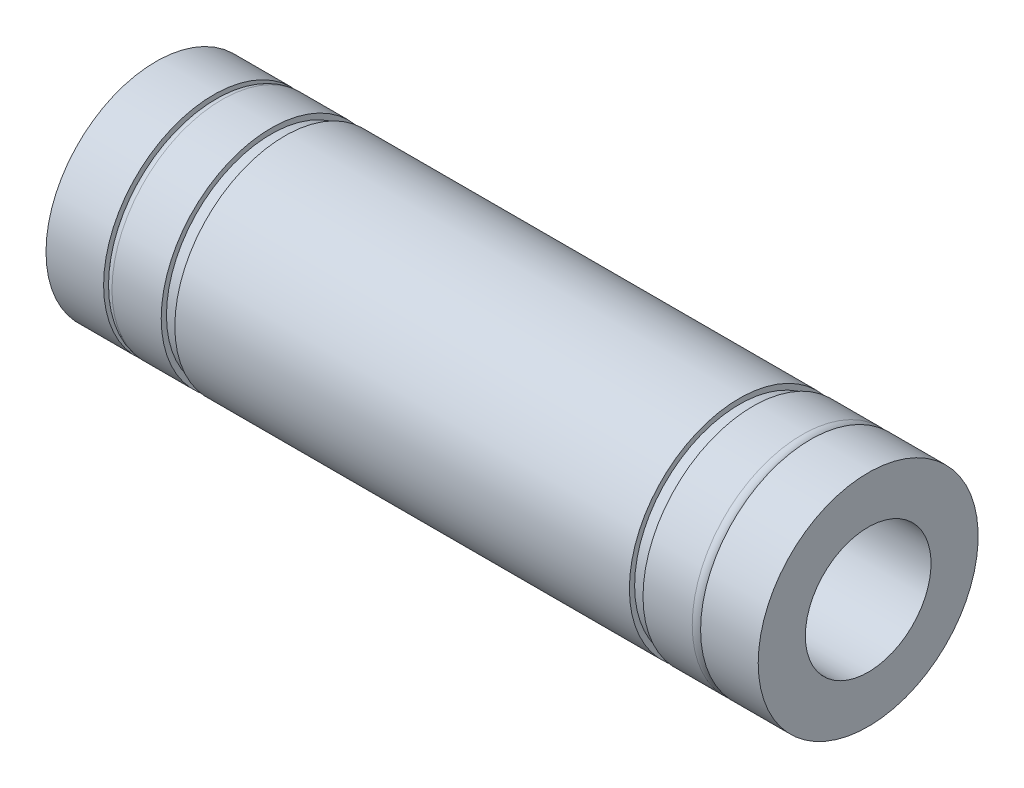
ISO-10303-21;
HEADER;
FILE_DESCRIPTION(('STEP AP214'),'2;1');
FILE_NAME('part.step','',(''),(''),'','','');
FILE_SCHEMA(('AUTOMOTIVE_DESIGN { 1 0 10303 214 1 1 1 1 }'));
ENDSEC;
DATA;
#1=APPLICATION_CONTEXT('core data for automotive mechanical design processes');
#2=APPLICATION_PROTOCOL_DEFINITION('international standard','automotive_design',2000,#1);
#3=PRODUCT_CONTEXT('',#1,'mechanical');
#4=PRODUCT('Part','Part','',(#3));
#5=PRODUCT_RELATED_PRODUCT_CATEGORY('part','',(#4));
#6=PRODUCT_DEFINITION_FORMATION('','',#4);
#7=PRODUCT_DEFINITION_CONTEXT('part definition',#1,'design');
#8=PRODUCT_DEFINITION('design','',#6,#7);
#9=PRODUCT_DEFINITION_SHAPE('','',#8);
#10=(LENGTH_UNIT() NAMED_UNIT(*) SI_UNIT(.MILLI.,.METRE.));
#11=(NAMED_UNIT(*) PLANE_ANGLE_UNIT() SI_UNIT($,.RADIAN.));
#12=(NAMED_UNIT(*) SI_UNIT($,.STERADIAN.) SOLID_ANGLE_UNIT());
#13=UNCERTAINTY_MEASURE_WITH_UNIT(LENGTH_MEASURE(1.E-05),#10,'distance_accuracy_value','');
#14=(GEOMETRIC_REPRESENTATION_CONTEXT(3) GLOBAL_UNCERTAINTY_ASSIGNED_CONTEXT((#13)) GLOBAL_UNIT_ASSIGNED_CONTEXT((#10,
#11,#12)) REPRESENTATION_CONTEXT('',''));
#15=CARTESIAN_POINT('',(0.,0.,0.));
#16=DIRECTION('',(0.,0.,1.));
#17=DIRECTION('',(1.,0.,0.));
#18=AXIS2_PLACEMENT_3D('',#15,#16,#17);
#19=CARTESIAN_POINT('',(28.5,0.,0.));
#20=DIRECTION('',(-1.,0.,0.));
#21=DIRECTION('',(0.,0.,1.));
#22=AXIS2_PLACEMENT_3D('',#19,#20,#21);
#23=CYLINDRICAL_SURFACE('',#22,6.);
#24=CARTESIAN_POINT('',(62.5,0.,0.));
#25=DIRECTION('',(-1.,0.,0.));
#26=DIRECTION('',(0.,0.,1.));
#27=AXIS2_PLACEMENT_3D('',#24,#25,#26);
#28=CIRCLE('',#27,6.);
#29=CARTESIAN_POINT('',(62.5,0.,6.));
#30=VERTEX_POINT('',#29);
#31=EDGE_CURVE('E149',#30,#30,#28,.F.);
#32=ORIENTED_EDGE('',*,*,#31,.T.);
#33=EDGE_LOOP('',(#32));
#34=FACE_BOUND('',#33,.T.);
#35=CARTESIAN_POINT('',(-5.5,0.,0.));
#36=DIRECTION('',(-1.,0.,0.));
#37=DIRECTION('',(0.,0.,1.));
#38=AXIS2_PLACEMENT_3D('',#35,#36,#37);
#39=CIRCLE('',#38,6.);
#40=CARTESIAN_POINT('',(-5.5,0.,6.));
#41=VERTEX_POINT('',#40);
#42=EDGE_CURVE('E146',#41,#41,#39,.T.);
#43=ORIENTED_EDGE('',*,*,#42,.T.);
#44=EDGE_LOOP('',(#43));
#45=FACE_BOUND('',#44,.T.);
#46=ADVANCED_FACE('F17',(#34,#45),#23,.F.);
#47=CARTESIAN_POINT('',(62.5,6.,0.));
#48=DIRECTION('',(-1.,0.,0.));
#49=DIRECTION('',(0.,0.,1.));
#50=AXIS2_PLACEMENT_3D('',#47,#48,#49);
#51=PLANE('',#50);
#52=ORIENTED_EDGE('',*,*,#31,.F.);
#53=EDGE_LOOP('',(#52));
#54=FACE_BOUND('',#53,.T.);
#55=CARTESIAN_POINT('',(62.5,0.,0.));
#56=DIRECTION('',(-1.,0.,0.));
#57=DIRECTION('',(0.,0.,1.));
#58=AXIS2_PLACEMENT_3D('',#55,#56,#57);
#59=CIRCLE('',#58,10.5);
#60=CARTESIAN_POINT('',(62.5,0.,10.5));
#61=VERTEX_POINT('',#60);
#62=EDGE_CURVE('E143',#61,#61,#59,.T.);
#63=ORIENTED_EDGE('',*,*,#62,.F.);
#64=EDGE_LOOP('',(#63));
#65=FACE_BOUND('',#64,.T.);
#66=ADVANCED_FACE('F163',(#54,#65),#51,.F.);
#67=CARTESIAN_POINT('',(-5.5,10.5,0.));
#68=DIRECTION('',(1.,0.,0.));
#69=DIRECTION('',(0.,0.,-1.));
#70=AXIS2_PLACEMENT_3D('',#67,#68,#69);
#71=PLANE('',#70);
#72=CARTESIAN_POINT('',(-5.5,0.,0.));
#73=DIRECTION('',(-1.,0.,0.));
#74=DIRECTION('',(0.,0.,1.));
#75=AXIS2_PLACEMENT_3D('',#72,#73,#74);
#76=CIRCLE('',#75,10.5);
#77=CARTESIAN_POINT('',(-5.5,0.,10.5));
#78=VERTEX_POINT('',#77);
#79=EDGE_CURVE('E140',#78,#78,#76,.F.);
#80=ORIENTED_EDGE('',*,*,#79,.F.);
#81=EDGE_LOOP('',(#80));
#82=FACE_BOUND('',#81,.T.);
#83=ORIENTED_EDGE('',*,*,#42,.F.);
#84=EDGE_LOOP('',(#83));
#85=FACE_BOUND('',#84,.T.);
#86=ADVANCED_FACE('F166',(#82,#85),#71,.F.);
#87=CARTESIAN_POINT('',(50.,0.,0.));
#88=DIRECTION('',(-1.,0.,0.));
#89=DIRECTION('',(0.,0.,1.));
#90=AXIS2_PLACEMENT_3D('',#87,#88,#89);
#91=CYLINDRICAL_SURFACE('',#90,10.5);
#92=CARTESIAN_POINT('',(57.,0.,0.));
#93=DIRECTION('',(-1.,0.,0.));
#94=DIRECTION('',(0.,0.,1.));
#95=AXIS2_PLACEMENT_3D('',#92,#93,#94);
#96=CIRCLE('',#95,10.5);
#97=CARTESIAN_POINT('',(57.,0.,10.5));
#98=VERTEX_POINT('',#97);
#99=EDGE_CURVE('E137',#98,#98,#96,.F.);
#100=ORIENTED_EDGE('',*,*,#99,.T.);
#101=EDGE_LOOP('',(#100));
#102=FACE_BOUND('',#101,.T.);
#103=ORIENTED_EDGE('',*,*,#62,.T.);
#104=EDGE_LOOP('',(#103));
#105=FACE_BOUND('',#104,.T.);
#106=ADVANCED_FACE('F169',(#102,#105),#91,.T.);
#107=CARTESIAN_POINT('',(50.,0.,0.));
#108=DIRECTION('',(-1.,0.,0.));
#109=DIRECTION('',(0.,0.,1.));
#110=AXIS2_PLACEMENT_3D('',#107,#108,#109);
#111=CYLINDRICAL_SURFACE('',#110,10.5);
#112=ORIENTED_EDGE('',*,*,#79,.T.);
#113=EDGE_LOOP('',(#112));
#114=FACE_BOUND('',#113,.T.);
#115=CARTESIAN_POINT('',(0.,0.,0.));
#116=DIRECTION('',(-1.,0.,0.));
#117=DIRECTION('',(0.,0.,1.));
#118=AXIS2_PLACEMENT_3D('',#115,#116,#117);
#119=CIRCLE('',#118,10.5);
#120=CARTESIAN_POINT('',(0.,0.,10.5));
#121=VERTEX_POINT('',#120);
#122=EDGE_CURVE('E52',#121,#121,#119,.T.);
#123=ORIENTED_EDGE('',*,*,#122,.T.);
#124=EDGE_LOOP('',(#123));
#125=FACE_BOUND('',#124,.T.);
#126=ADVANCED_FACE('F171',(#114,#125),#111,.T.);
#127=CARTESIAN_POINT('',(57.,10.5,0.));
#128=DIRECTION('',(1.,0.,0.));
#129=DIRECTION('',(0.,0.,-1.));
#130=AXIS2_PLACEMENT_3D('',#127,#128,#129);
#131=PLANE('',#130);
#132=ORIENTED_EDGE('',*,*,#99,.F.);
#133=EDGE_LOOP('',(#132));
#134=FACE_BOUND('',#133,.T.);
#135=CARTESIAN_POINT('',(57.,0.,0.));
#136=DIRECTION('',(-1.,0.,0.));
#137=DIRECTION('',(0.,0.,-1.));
#138=AXIS2_PLACEMENT_3D('',#135,#136,#137);
#139=CIRCLE('',#138,9.7);
#140=CARTESIAN_POINT('',(57.,0.,-9.7));
#141=VERTEX_POINT('',#140);
#142=CARTESIAN_POINT('',(57.,0.,9.7));
#143=VERTEX_POINT('',#142);
#144=EDGE_CURVE('E48',#141,#143,#139,.T.);
#145=ORIENTED_EDGE('',*,*,#144,.F.);
#146=CARTESIAN_POINT('',(57.,0.,0.));
#147=DIRECTION('',(-1.,0.,0.));
#148=DIRECTION('',(0.,0.,1.));
#149=AXIS2_PLACEMENT_3D('',#146,#147,#148);
#150=CIRCLE('',#149,9.7);
#151=EDGE_CURVE('E45',#143,#141,#150,.T.);
#152=ORIENTED_EDGE('',*,*,#151,.F.);
#153=EDGE_LOOP('',(#145,#152));
#154=FACE_BOUND('',#153,.T.);
#155=ADVANCED_FACE('F50',(#134,#154),#131,.F.);
#156=CARTESIAN_POINT('',(0.,6.,0.));
#157=DIRECTION('',(-1.,0.,0.));
#158=DIRECTION('',(0.,0.,1.));
#159=AXIS2_PLACEMENT_3D('',#156,#157,#158);
#160=PLANE('',#159);
#161=CARTESIAN_POINT('',(0.,0.,0.));
#162=DIRECTION('',(1.,0.,0.));
#163=DIRECTION('',(0.,0.,1.));
#164=AXIS2_PLACEMENT_3D('',#161,#162,#163);
#165=CIRCLE('',#164,9.7);
#166=CARTESIAN_POINT('',(0.,0.,9.7));
#167=VERTEX_POINT('',#166);
#168=CARTESIAN_POINT('',(0.,0.,-9.7));
#169=VERTEX_POINT('',#168);
#170=EDGE_CURVE('E36',#167,#169,#165,.T.);
#171=ORIENTED_EDGE('',*,*,#170,.F.);
#172=CARTESIAN_POINT('',(0.,0.,0.));
#173=DIRECTION('',(1.,0.,0.));
#174=DIRECTION('',(0.,0.,-1.));
#175=AXIS2_PLACEMENT_3D('',#172,#173,#174);
#176=CIRCLE('',#175,9.7);
#177=EDGE_CURVE('E96',#169,#167,#176,.T.);
#178=ORIENTED_EDGE('',*,*,#177,.F.);
#179=EDGE_LOOP('',(#171,#178));
#180=FACE_BOUND('',#179,.T.);
#181=ORIENTED_EDGE('',*,*,#122,.F.);
#182=EDGE_LOOP('',(#181));
#183=FACE_BOUND('',#182,.T.);
#184=ADVANCED_FACE('F76',(#180,#183),#160,.F.);
#185=CARTESIAN_POINT('',(56.2,0.,0.));
#186=DIRECTION('',(-1.,0.,0.));
#187=DIRECTION('',(0.,0.,1.));
#188=AXIS2_PLACEMENT_3D('',#185,#186,#187);
#189=TOROIDAL_SURFACE('',#188,9.7,0.800000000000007);
#190=CARTESIAN_POINT('',(56.2,0.,0.));
#191=DIRECTION('',(-1.,0.,0.));
#192=DIRECTION('',(0.,0.,1.));
#193=AXIS2_PLACEMENT_3D('',#190,#191,#192);
#194=CIRCLE('',#193,10.5);
#195=CARTESIAN_POINT('',(56.2,0.,10.5));
#196=VERTEX_POINT('',#195);
#197=EDGE_CURVE('E85',#196,#196,#194,.T.);
#198=ORIENTED_EDGE('',*,*,#197,.F.);
#199=EDGE_LOOP('',(#198));
#200=FACE_BOUND('',#199,.T.);
#201=ORIENTED_EDGE('',*,*,#151,.T.);
#202=ORIENTED_EDGE('',*,*,#144,.T.);
#203=EDGE_LOOP('',(#201,#202));
#204=FACE_BOUND('',#203,.T.);
#205=ADVANCED_FACE('F56',(#200,#204),#189,.T.);
#206=CARTESIAN_POINT('',(0.800000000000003,0.,0.));
#207=DIRECTION('',(-1.,0.,0.));
#208=DIRECTION('',(0.,0.,1.));
#209=AXIS2_PLACEMENT_3D('',#206,#207,#208);
#210=TOROIDAL_SURFACE('',#209,9.7,0.800000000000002);
#211=ORIENTED_EDGE('',*,*,#170,.T.);
#212=ORIENTED_EDGE('',*,*,#177,.T.);
#213=EDGE_LOOP('',(#211,#212));
#214=FACE_BOUND('',#213,.T.);
#215=CARTESIAN_POINT('',(0.799999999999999,0.,0.));
#216=DIRECTION('',(-1.,0.,0.));
#217=DIRECTION('',(0.,0.,1.));
#218=AXIS2_PLACEMENT_3D('',#215,#216,#217);
#219=CIRCLE('',#218,10.5);
#220=CARTESIAN_POINT('',(0.799999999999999,0.,10.5));
#221=VERTEX_POINT('',#220);
#222=EDGE_CURVE('E116',#221,#221,#219,.F.);
#223=ORIENTED_EDGE('',*,*,#222,.F.);
#224=EDGE_LOOP('',(#223));
#225=FACE_BOUND('',#224,.T.);
#226=ADVANCED_FACE('F75',(#214,#225),#210,.T.);
#227=CARTESIAN_POINT('',(28.5,0.,0.));
#228=DIRECTION('',(-1.,0.,0.));
#229=DIRECTION('',(0.,0.,1.));
#230=AXIS2_PLACEMENT_3D('',#227,#228,#229);
#231=CYLINDRICAL_SURFACE('',#230,10.5);
#232=CARTESIAN_POINT('',(51.5,0.,0.));
#233=DIRECTION('',(-1.,0.,0.));
#234=DIRECTION('',(0.,0.,1.));
#235=AXIS2_PLACEMENT_3D('',#232,#233,#234);
#236=CIRCLE('',#235,10.5);
#237=CARTESIAN_POINT('',(51.5,0.,10.5));
#238=VERTEX_POINT('',#237);
#239=EDGE_CURVE('E120',#238,#238,#236,.F.);
#240=ORIENTED_EDGE('',*,*,#239,.T.);
#241=EDGE_LOOP('',(#240));
#242=FACE_BOUND('',#241,.T.);
#243=ORIENTED_EDGE('',*,*,#197,.T.);
#244=EDGE_LOOP('',(#243));
#245=FACE_BOUND('',#244,.T.);
#246=ADVANCED_FACE('F217',(#242,#245),#231,.T.);
#247=CARTESIAN_POINT('',(28.5,0.,0.));
#248=DIRECTION('',(-1.,0.,0.));
#249=DIRECTION('',(0.,0.,1.));
#250=AXIS2_PLACEMENT_3D('',#247,#248,#249);
#251=CYLINDRICAL_SURFACE('',#250,10.5);
#252=ORIENTED_EDGE('',*,*,#222,.T.);
#253=EDGE_LOOP('',(#252));
#254=FACE_BOUND('',#253,.T.);
#255=CARTESIAN_POINT('',(5.5,0.,0.));
#256=DIRECTION('',(-1.,0.,0.));
#257=DIRECTION('',(0.,0.,1.));
#258=AXIS2_PLACEMENT_3D('',#255,#256,#257);
#259=CIRCLE('',#258,10.5);
#260=CARTESIAN_POINT('',(5.5,0.,10.5));
#261=VERTEX_POINT('',#260);
#262=EDGE_CURVE('E125',#261,#261,#259,.T.);
#263=ORIENTED_EDGE('',*,*,#262,.T.);
#264=EDGE_LOOP('',(#263));
#265=FACE_BOUND('',#264,.T.);
#266=ADVANCED_FACE('F214',(#254,#265),#251,.T.);
#267=CARTESIAN_POINT('',(51.5,10.5,0.));
#268=DIRECTION('',(1.,0.,0.));
#269=DIRECTION('',(0.,0.,-1.));
#270=AXIS2_PLACEMENT_3D('',#267,#268,#269);
#271=PLANE('',#270);
#272=ORIENTED_EDGE('',*,*,#239,.F.);
#273=EDGE_LOOP('',(#272));
#274=FACE_BOUND('',#273,.T.);
#275=CARTESIAN_POINT('',(51.5,0.,0.));
#276=DIRECTION('',(-1.,0.,0.));
#277=DIRECTION('',(0.,0.,1.));
#278=AXIS2_PLACEMENT_3D('',#275,#276,#277);
#279=CIRCLE('',#278,10.);
#280=CARTESIAN_POINT('',(51.5,0.,10.));
#281=VERTEX_POINT('',#280);
#282=EDGE_CURVE('E131',#281,#281,#279,.T.);
#283=ORIENTED_EDGE('',*,*,#282,.F.);
#284=EDGE_LOOP('',(#283));
#285=FACE_BOUND('',#284,.T.);
#286=ADVANCED_FACE('F210',(#274,#285),#271,.F.);
#287=CARTESIAN_POINT('',(5.5,10.,0.));
#288=DIRECTION('',(-1.,0.,0.));
#289=DIRECTION('',(0.,0.,1.));
#290=AXIS2_PLACEMENT_3D('',#287,#288,#289);
#291=PLANE('',#290);
#292=CARTESIAN_POINT('',(5.5,0.,0.));
#293=DIRECTION('',(-1.,0.,0.));
#294=DIRECTION('',(0.,0.,1.));
#295=AXIS2_PLACEMENT_3D('',#292,#293,#294);
#296=CIRCLE('',#295,10.);
#297=CARTESIAN_POINT('',(5.5,0.,10.));
#298=VERTEX_POINT('',#297);
#299=EDGE_CURVE('E396',#298,#298,#296,.F.);
#300=ORIENTED_EDGE('',*,*,#299,.F.);
#301=EDGE_LOOP('',(#300));
#302=FACE_BOUND('',#301,.T.);
#303=ORIENTED_EDGE('',*,*,#262,.F.);
#304=EDGE_LOOP('',(#303));
#305=FACE_BOUND('',#304,.T.);
#306=ADVANCED_FACE('F206',(#302,#305),#291,.F.);
#307=CARTESIAN_POINT('',(28.5,0.,0.));
#308=DIRECTION('',(-1.,0.,0.));
#309=DIRECTION('',(0.,0.,1.));
#310=AXIS2_PLACEMENT_3D('',#307,#308,#309);
#311=CYLINDRICAL_SURFACE('',#310,10.);
#312=CARTESIAN_POINT('',(50.2,0.,0.));
#313=DIRECTION('',(-1.,0.,0.));
#314=DIRECTION('',(0.,0.,1.));
#315=AXIS2_PLACEMENT_3D('',#312,#313,#314);
#316=CIRCLE('',#315,10.);
#317=CARTESIAN_POINT('',(50.2,0.,10.));
#318=VERTEX_POINT('',#317);
#319=EDGE_CURVE('E398',#318,#318,#316,.F.);
#320=ORIENTED_EDGE('',*,*,#319,.T.);
#321=EDGE_LOOP('',(#320));
#322=FACE_BOUND('',#321,.T.);
#323=ORIENTED_EDGE('',*,*,#282,.T.);
#324=EDGE_LOOP('',(#323));
#325=FACE_BOUND('',#324,.T.);
#326=ADVANCED_FACE('F202',(#322,#325),#311,.T.);
#327=CARTESIAN_POINT('',(28.5,0.,0.));
#328=DIRECTION('',(-1.,0.,0.));
#329=DIRECTION('',(0.,0.,1.));
#330=AXIS2_PLACEMENT_3D('',#327,#328,#329);
#331=CYLINDRICAL_SURFACE('',#330,10.);
#332=ORIENTED_EDGE('',*,*,#299,.T.);
#333=EDGE_LOOP('',(#332));
#334=FACE_BOUND('',#333,.T.);
#335=CARTESIAN_POINT('',(6.8,0.,0.));
#336=DIRECTION('',(-1.,0.,0.));
#337=DIRECTION('',(0.,0.,1.));
#338=AXIS2_PLACEMENT_3D('',#335,#336,#337);
#339=CIRCLE('',#338,10.);
#340=CARTESIAN_POINT('',(6.8,0.,10.));
#341=VERTEX_POINT('',#340);
#342=EDGE_CURVE('E403',#341,#341,#339,.T.);
#343=ORIENTED_EDGE('',*,*,#342,.T.);
#344=EDGE_LOOP('',(#343));
#345=FACE_BOUND('',#344,.T.);
#346=ADVANCED_FACE('F198',(#334,#345),#331,.T.);
#347=CARTESIAN_POINT('',(50.2,10.,0.));
#348=DIRECTION('',(-1.,0.,0.));
#349=DIRECTION('',(0.,0.,1.));
#350=AXIS2_PLACEMENT_3D('',#347,#348,#349);
#351=PLANE('',#350);
#352=ORIENTED_EDGE('',*,*,#319,.F.);
#353=EDGE_LOOP('',(#352));
#354=FACE_BOUND('',#353,.T.);
#355=CARTESIAN_POINT('',(50.2,0.,0.));
#356=DIRECTION('',(-1.,0.,0.));
#357=DIRECTION('',(0.,0.,1.));
#358=AXIS2_PLACEMENT_3D('',#355,#356,#357);
#359=CIRCLE('',#358,10.5);
#360=CARTESIAN_POINT('',(50.2,0.,10.5));
#361=VERTEX_POINT('',#360);
#362=EDGE_CURVE('E28',#361,#361,#359,.T.);
#363=ORIENTED_EDGE('',*,*,#362,.F.);
#364=EDGE_LOOP('',(#363));
#365=FACE_BOUND('',#364,.T.);
#366=ADVANCED_FACE('F191',(#354,#365),#351,.F.);
#367=CARTESIAN_POINT('',(6.8,10.5,0.));
#368=DIRECTION('',(1.,0.,0.));
#369=DIRECTION('',(0.,0.,-1.));
#370=AXIS2_PLACEMENT_3D('',#367,#368,#369);
#371=PLANE('',#370);
#372=CARTESIAN_POINT('',(6.8,0.,0.));
#373=DIRECTION('',(-1.,0.,0.));
#374=DIRECTION('',(0.,0.,1.));
#375=AXIS2_PLACEMENT_3D('',#372,#373,#374);
#376=CIRCLE('',#375,10.5);
#377=CARTESIAN_POINT('',(6.8,0.,10.5));
#378=VERTEX_POINT('',#377);
#379=EDGE_CURVE('E11',#378,#378,#376,.F.);
#380=ORIENTED_EDGE('',*,*,#379,.F.);
#381=EDGE_LOOP('',(#380));
#382=FACE_BOUND('',#381,.T.);
#383=ORIENTED_EDGE('',*,*,#342,.F.);
#384=EDGE_LOOP('',(#383));
#385=FACE_BOUND('',#384,.T.);
#386=ADVANCED_FACE('F185',(#382,#385),#371,.F.);
#387=CARTESIAN_POINT('',(28.5,0.,0.));
#388=DIRECTION('',(-1.,0.,0.));
#389=DIRECTION('',(0.,0.,1.));
#390=AXIS2_PLACEMENT_3D('',#387,#388,#389);
#391=CYLINDRICAL_SURFACE('',#390,10.5);
#392=ORIENTED_EDGE('',*,*,#379,.T.);
#393=EDGE_LOOP('',(#392));
#394=FACE_BOUND('',#393,.T.);
#395=ORIENTED_EDGE('',*,*,#362,.T.);
#396=EDGE_LOOP('',(#395));
#397=FACE_BOUND('',#396,.T.);
#398=ADVANCED_FACE('F183',(#394,#397),#391,.T.);
#399=CLOSED_SHELL('',(#46,#66,#86,#106,#126,#155,#184,#205,#226,#246,#266,#286,#306,#326,#346,
#366,#386,#398));
#400=MANIFOLD_SOLID_BREP('B1',#399);
#401=ADVANCED_BREP_SHAPE_REPRESENTATION('',(#18,#400),#14);
#402=SHAPE_DEFINITION_REPRESENTATION(#9,#401);
ENDSEC;
END-ISO-10303-21;
